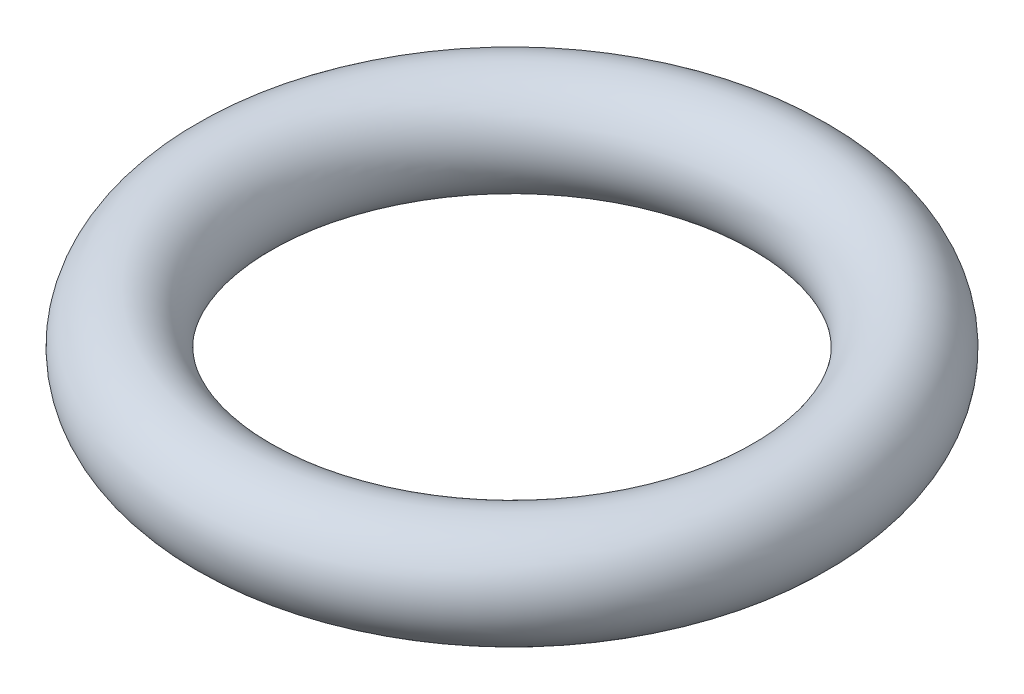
ISO-10303-21;
HEADER;
FILE_DESCRIPTION(('STEP AP214'),'2;1');
FILE_NAME('part.step','',(''),(''),'','','');
FILE_SCHEMA(('AUTOMOTIVE_DESIGN { 1 0 10303 214 1 1 1 1 }'));
ENDSEC;
DATA;
#1=APPLICATION_CONTEXT('core data for automotive mechanical design processes');
#2=APPLICATION_PROTOCOL_DEFINITION('international standard','automotive_design',2000,#1);
#3=PRODUCT_CONTEXT('',#1,'mechanical');
#4=PRODUCT('Part','Part','',(#3));
#5=PRODUCT_RELATED_PRODUCT_CATEGORY('part','',(#4));
#6=PRODUCT_DEFINITION_FORMATION('','',#4);
#7=PRODUCT_DEFINITION_CONTEXT('part definition',#1,'design');
#8=PRODUCT_DEFINITION('design','',#6,#7);
#9=PRODUCT_DEFINITION_SHAPE('','',#8);
#10=(LENGTH_UNIT() NAMED_UNIT(*) SI_UNIT(.MILLI.,.METRE.));
#11=(NAMED_UNIT(*) PLANE_ANGLE_UNIT() SI_UNIT($,.RADIAN.));
#12=(NAMED_UNIT(*) SI_UNIT($,.STERADIAN.) SOLID_ANGLE_UNIT());
#13=UNCERTAINTY_MEASURE_WITH_UNIT(LENGTH_MEASURE(1.E-05),#10,'distance_accuracy_value','');
#14=(GEOMETRIC_REPRESENTATION_CONTEXT(3) GLOBAL_UNCERTAINTY_ASSIGNED_CONTEXT((#13)) GLOBAL_UNIT_ASSIGNED_CONTEXT((#10,
#11,#12)) REPRESENTATION_CONTEXT('',''));
#15=CARTESIAN_POINT('',(0.,0.,0.));
#16=DIRECTION('',(0.,0.,1.));
#17=DIRECTION('',(1.,0.,0.));
#18=AXIS2_PLACEMENT_3D('',#15,#16,#17);
#19=CARTESIAN_POINT('',(0.,0.,0.));
#20=DIRECTION('',(0.,-1.,0.));
#21=DIRECTION('',(0.,0.,-1.));
#22=AXIS2_PLACEMENT_3D('',#19,#20,#21);
#23=TOROIDAL_SURFACE('',#22,1.3589,0.254000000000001);
#24=CARTESIAN_POINT('',(0.,0.,-1.6129));
#25=VERTEX_POINT('',#24);
#26=VERTEX_LOOP('',#25);
#27=FACE_BOUND('',#26,.T.);
#28=ADVANCED_FACE('F28',(#27),#23,.T.);
#29=CLOSED_SHELL('',(#28));
#30=MANIFOLD_SOLID_BREP('B2',#29);
#31=ADVANCED_BREP_SHAPE_REPRESENTATION('',(#18,#30),#14);
#32=SHAPE_DEFINITION_REPRESENTATION(#9,#31);
ENDSEC;
END-ISO-10303-21;
